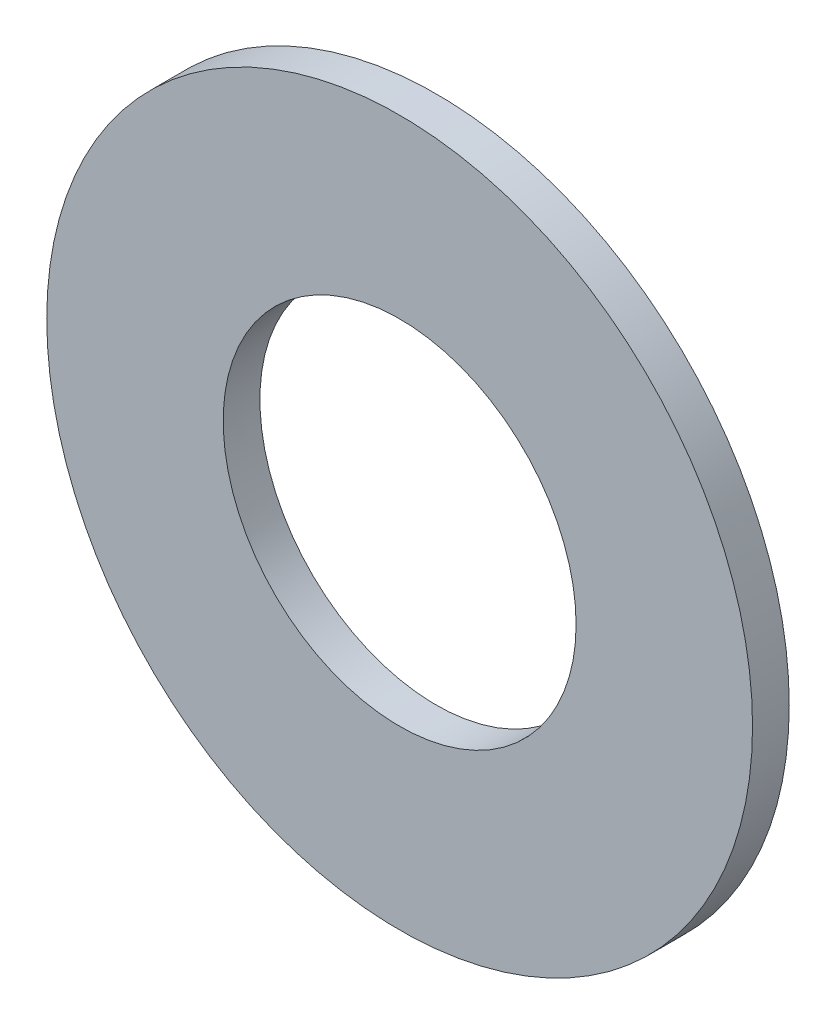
from build123d import *

# Parameters (mm, degrees)
SKETCH1_R                    = 3.175
EXTRUDE1_DEPTH               = 0.1651
F_1_8_0_125_DIAMETER_HOLE1_D = 3.175


with BuildPart() as part:
    # Sketch1 → Extrude1 (new, symmetric)
    with BuildSketch(Plane.XY):
        Circle(SKETCH1_R)
    extrude(amount=EXTRUDE1_DEPTH, both=True)

    # 1_8 _0.125_ Diameter Hole1 (through all)
    with Locations(Plane.XY.offset(0.1651)):
        with Locations((0, 0)):
            Hole(F_1_8_0_125_DIAMETER_HOLE1_D / 2)


solid = part.part
